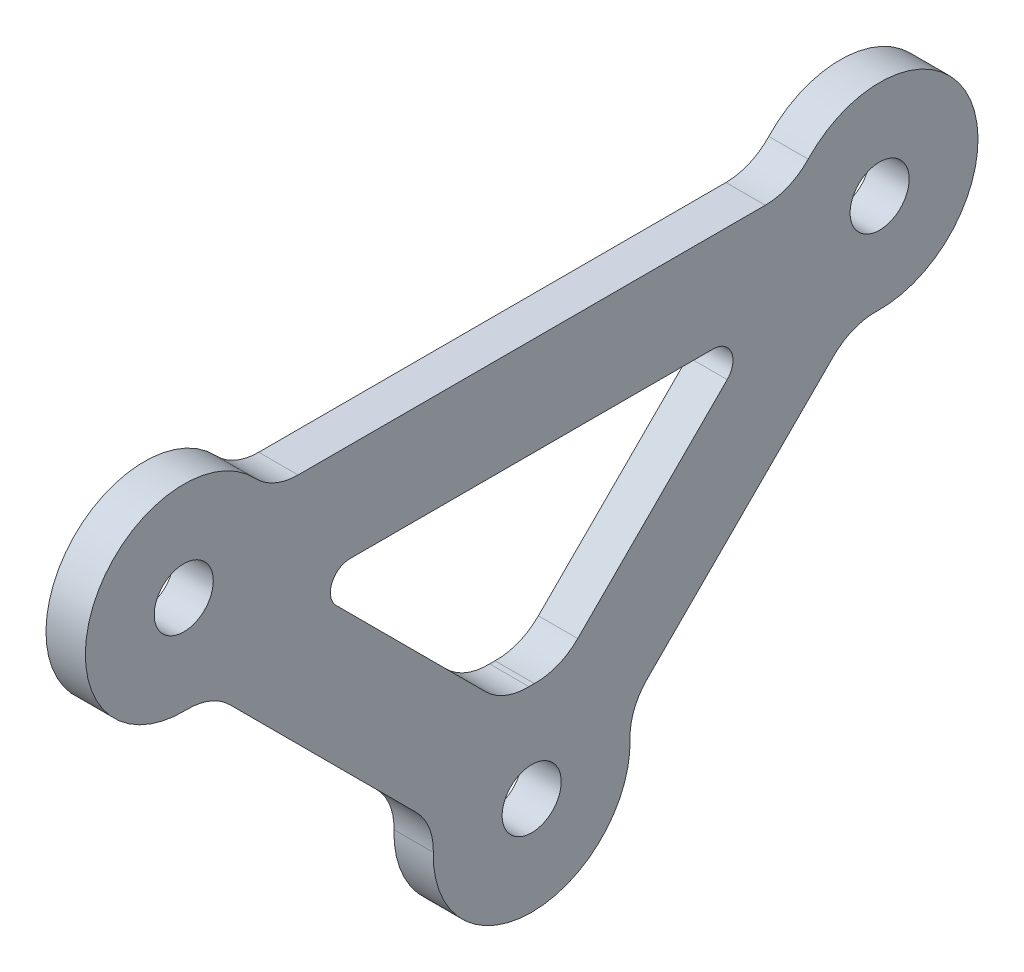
from build123d import *

# Parameters (mm, degrees)
SKETCH1_R           = 1.5
BOSS_EXTRUDE1_DEPTH = 2
FILLET3_R           = 2.5
BOSS_EXTRUDE2_START = -2
SKETCH6_R           = 5
SKETCH6_R_2         = 1.5
BOSS_EXTRUDE2_DEPTH = 2
FILLET4_R           = 3
FILLET5_R           = 1


with BuildPart() as part:
    # Sketch1 → Boss-Extrude1 (new body)
    with BuildSketch(Plane(origin=(0, 0, 0), x_dir=(0, 0, -1), z_dir=(1, 0, 0))):
        Polygon((0, -3.535533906), (23.713203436, 20.17766953), (-23.713203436, 20.17766953), align=None)
        with Locations((-17.67766953, 17.67766953)):
            Circle(SKETCH1_R, mode=Mode.SUBTRACT)
        with Locations((17.67766953, 17.67766953)):
            Circle(SKETCH1_R, mode=Mode.SUBTRACT)
        Circle(SKETCH1_R, mode=Mode.SUBTRACT)
        Polygon((0, 3.535533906), (11.642135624, 15.17766953), (-11.642135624, 15.17766953), align=None, mode=Mode.SUBTRACT)
    extrude(amount=BOSS_EXTRUDE1_DEPTH)

    # Fillet3
    fillet3_edges = [part.edges().sort_by_distance(p)[0] for p in [
        (1, 20.17766953, 23.713203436),
        (1, 20.17766953, -23.713203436),
        (1, -3.535533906, 0),
    ]]
    fillet(fillet3_edges, radius=FILLET3_R)

    # Sketch6 → Boss-Extrude2 (add)
    # profile 1 of 3: a face of its own
    with BuildSketch(Plane(origin=(2, 0, 0), x_dir=(0, 0, -1), z_dir=(1, 0, 0)).offset(BOSS_EXTRUDE2_START)):
        with Locations((-17.67766953, 17.67766953)):
            Circle(SKETCH6_R)
        with Locations((-17.67766953, 17.67766953)):
            Circle(SKETCH6_R_2, mode=Mode.SUBTRACT)
    # profile 2 of 3: a face of its own
    with BuildSketch(Plane(origin=(2, 0, 0), x_dir=(0, 0, -1), z_dir=(1, 0, 0)).offset(BOSS_EXTRUDE2_START)):
        with Locations((17.67766953, 17.67766953)):
            Circle(SKETCH6_R)
        with Locations((17.67766953, 17.67766953)):
            Circle(SKETCH6_R_2, mode=Mode.SUBTRACT)
    # profile 3 of 3: a face of its own
    with BuildSketch(Plane(origin=(2, 0, 0), x_dir=(0, 0, -1), z_dir=(1, 0, 0)).offset(BOSS_EXTRUDE2_START)):
        Circle(SKETCH6_R)
        Circle(SKETCH6_R_2, mode=Mode.SUBTRACT)
    extrude(amount=BOSS_EXTRUDE2_DEPTH)

    # Fillet4
    fillet4_edges = [part.edges().sort_by_distance(p)[0] for p in [
        (1, 20.17766953, 13.347542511),
        (1, 12.848040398, 16.383574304),
        (1, 20.17766953, -13.347542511),
        (1, 12.848040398, -16.383574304),
        (1, 4.829629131, -1.294095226),
        (1, 1.294095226, 4.829629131),
        (1, 1.294095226, -4.829629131),
        (1, 4.829629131, 1.294095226),
    ]]
    fillet(fillet4_edges, radius=FILLET4_R)

    # Fillet5
    fillet5_edges = [part.edges().sort_by_distance(p)[0] for p in [
        (1, 15.17766953, 11.642135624),
        (1, 15.17766953, -11.642135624),
    ]]
    fillet(fillet5_edges, radius=FILLET5_R)


solid = part.part
